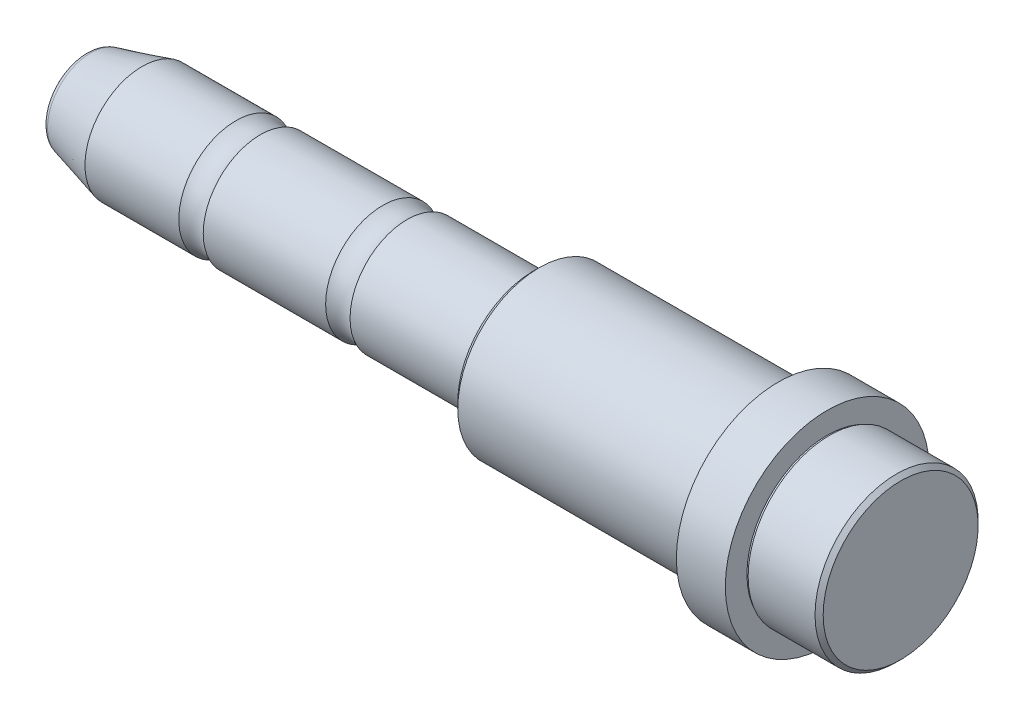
ISO-10303-21;
HEADER;
FILE_DESCRIPTION(('STEP AP214'),'2;1');
FILE_NAME('part.step','',(''),(''),'','','');
FILE_SCHEMA(('AUTOMOTIVE_DESIGN { 1 0 10303 214 1 1 1 1 }'));
ENDSEC;
DATA;
#1=APPLICATION_CONTEXT('core data for automotive mechanical design processes');
#2=APPLICATION_PROTOCOL_DEFINITION('international standard','automotive_design',2000,#1);
#3=PRODUCT_CONTEXT('',#1,'mechanical');
#4=PRODUCT('Part','Part','',(#3));
#5=PRODUCT_RELATED_PRODUCT_CATEGORY('part','',(#4));
#6=PRODUCT_DEFINITION_FORMATION('','',#4);
#7=PRODUCT_DEFINITION_CONTEXT('part definition',#1,'design');
#8=PRODUCT_DEFINITION('design','',#6,#7);
#9=PRODUCT_DEFINITION_SHAPE('','',#8);
#10=(LENGTH_UNIT() NAMED_UNIT(*) SI_UNIT(.MILLI.,.METRE.));
#11=(NAMED_UNIT(*) PLANE_ANGLE_UNIT() SI_UNIT($,.RADIAN.));
#12=(NAMED_UNIT(*) SI_UNIT($,.STERADIAN.) SOLID_ANGLE_UNIT());
#13=UNCERTAINTY_MEASURE_WITH_UNIT(LENGTH_MEASURE(1.E-05),#10,'distance_accuracy_value','');
#14=(GEOMETRIC_REPRESENTATION_CONTEXT(3) GLOBAL_UNCERTAINTY_ASSIGNED_CONTEXT((#13)) GLOBAL_UNIT_ASSIGNED_CONTEXT((#10,
#11,#12)) REPRESENTATION_CONTEXT('',''));
#15=CARTESIAN_POINT('',(0.,0.,0.));
#16=DIRECTION('',(0.,0.,1.));
#17=DIRECTION('',(1.,0.,0.));
#18=AXIS2_PLACEMENT_3D('',#15,#16,#17);
#19=CARTESIAN_POINT('',(90.9999999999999,0.,0.));
#20=DIRECTION('',(-1.,0.,0.));
#21=DIRECTION('',(0.,0.,1.));
#22=AXIS2_PLACEMENT_3D('',#19,#20,#21);
#23=CYLINDRICAL_SURFACE('',#22,7.);
#24=CARTESIAN_POINT('',(39.4966629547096,0.,0.));
#25=DIRECTION('',(-1.,0.,0.));
#26=DIRECTION('',(0.,0.,1.));
#27=AXIS2_PLACEMENT_3D('',#24,#25,#26);
#28=CIRCLE('',#27,7.);
#29=CARTESIAN_POINT('',(39.4966629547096,0.,7.));
#30=VERTEX_POINT('',#29);
#31=EDGE_CURVE('E18',#30,#30,#28,.T.);
#32=CARTESIAN_POINT('',(54.7,0.,0.));
#33=DIRECTION('',(-1.,0.,0.));
#34=DIRECTION('',(0.,0.,1.));
#35=AXIS2_PLACEMENT_3D('',#32,#33,#34);
#36=CIRCLE('',#35,7.);
#37=CARTESIAN_POINT('',(54.7,0.,7.));
#38=VERTEX_POINT('',#37);
#39=EDGE_CURVE('E54',#38,#38,#36,.T.);
#40=CARTESIAN_POINT('',(39.4966629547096,0.,7.));
#41=CARTESIAN_POINT('',(39.6550310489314,0.,7.));
#42=CARTESIAN_POINT('',(39.8133991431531,0.,7.));
#43=CARTESIAN_POINT('',(40.1301353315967,0.,7.));
#44=CARTESIAN_POINT('',(40.2885034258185,0.,7.));
#45=CARTESIAN_POINT('',(40.605239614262,0.,7.));
#46=CARTESIAN_POINT('',(40.7636077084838,0.,7.));
#47=CARTESIAN_POINT('',(41.0803438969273,0.,7.));
#48=CARTESIAN_POINT('',(41.2387119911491,0.,7.));
#49=CARTESIAN_POINT('',(41.5554481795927,0.,7.));
#50=CARTESIAN_POINT('',(41.7138162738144,0.,7.));
#51=CARTESIAN_POINT('',(42.030552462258,0.,7.));
#52=CARTESIAN_POINT('',(42.1889205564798,0.,7.));
#53=CARTESIAN_POINT('',(42.5056567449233,0.,7.));
#54=CARTESIAN_POINT('',(42.6640248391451,0.,7.));
#55=CARTESIAN_POINT('',(42.9807610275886,0.,7.));
#56=CARTESIAN_POINT('',(43.1391291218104,0.,7.));
#57=CARTESIAN_POINT('',(43.455865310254,0.,7.));
#58=CARTESIAN_POINT('',(43.6142334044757,0.,7.));
#59=CARTESIAN_POINT('',(43.9309695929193,0.,7.));
#60=CARTESIAN_POINT('',(44.0893376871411,0.,7.));
#61=CARTESIAN_POINT('',(44.4060738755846,0.,7.));
#62=CARTESIAN_POINT('',(44.5644419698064,0.,7.));
#63=CARTESIAN_POINT('',(44.8811781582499,0.,7.));
#64=CARTESIAN_POINT('',(45.0395462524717,0.,7.));
#65=CARTESIAN_POINT('',(45.3562824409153,0.,7.));
#66=CARTESIAN_POINT('',(45.514650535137,0.,7.));
#67=CARTESIAN_POINT('',(45.8313867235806,0.,7.));
#68=CARTESIAN_POINT('',(45.9897548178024,0.,7.));
#69=CARTESIAN_POINT('',(46.3064910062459,0.,7.));
#70=CARTESIAN_POINT('',(46.4648591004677,0.,7.));
#71=CARTESIAN_POINT('',(46.7815952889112,0.,7.));
#72=CARTESIAN_POINT('',(46.939963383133,0.,7.));
#73=CARTESIAN_POINT('',(47.2566995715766,0.,7.));
#74=CARTESIAN_POINT('',(47.4150676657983,0.,7.));
#75=CARTESIAN_POINT('',(47.7318038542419,0.,7.));
#76=CARTESIAN_POINT('',(47.8901719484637,0.,7.));
#77=CARTESIAN_POINT('',(48.2069081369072,0.,7.));
#78=CARTESIAN_POINT('',(48.365276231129,0.,7.));
#79=CARTESIAN_POINT('',(48.6820124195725,0.,7.));
#80=CARTESIAN_POINT('',(48.8403805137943,0.,7.));
#81=CARTESIAN_POINT('',(49.1571167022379,0.,7.));
#82=CARTESIAN_POINT('',(49.3154847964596,0.,7.));
#83=CARTESIAN_POINT('',(49.6322209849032,0.,7.));
#84=CARTESIAN_POINT('',(49.790589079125,0.,7.));
#85=CARTESIAN_POINT('',(50.1073252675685,0.,7.));
#86=CARTESIAN_POINT('',(50.2656933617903,0.,7.));
#87=CARTESIAN_POINT('',(50.5824295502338,0.,7.));
#88=CARTESIAN_POINT('',(50.7407976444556,0.,7.));
#89=CARTESIAN_POINT('',(51.0575338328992,0.,7.));
#90=CARTESIAN_POINT('',(51.2159019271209,0.,7.));
#91=CARTESIAN_POINT('',(51.5326381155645,0.,7.));
#92=CARTESIAN_POINT('',(51.6910062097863,0.,7.));
#93=CARTESIAN_POINT('',(52.0077423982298,0.,7.));
#94=CARTESIAN_POINT('',(52.1661104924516,0.,7.));
#95=CARTESIAN_POINT('',(52.4828466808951,0.,7.));
#96=CARTESIAN_POINT('',(52.6412147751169,0.,7.));
#97=CARTESIAN_POINT('',(52.9579509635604,0.,7.));
#98=CARTESIAN_POINT('',(53.1163190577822,0.,7.));
#99=CARTESIAN_POINT('',(53.4330552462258,0.,7.));
#100=CARTESIAN_POINT('',(53.5914233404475,0.,7.));
#101=CARTESIAN_POINT('',(53.9081595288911,0.,7.));
#102=CARTESIAN_POINT('',(54.0665276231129,0.,7.));
#103=CARTESIAN_POINT('',(54.3832638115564,0.,7.));
#104=CARTESIAN_POINT('',(54.5416319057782,0.,7.));
#105=CARTESIAN_POINT('',(54.7,0.,7.));
#106=B_SPLINE_CURVE_WITH_KNOTS('',3,(#40,#41,#42,#43,#44,#45,#46,#47,#48,#49,#50,#51,#52,#53,
#54,#55,#56,#57,#58,#59,#60,#61,#62,#63,#64,#65,#66,#67,#68,#69,#70,#71,#72,#73,#74,#75,#76,#77,
#78,#79,#80,#81,#82,#83,#84,#85,#86,#87,#88,#89,#90,#91,#92,#93,#94,#95,#96,#97,#98,#99,#100,
#101,#102,#103,#104,#105),.UNSPECIFIED.,.F.,.F.,(4,2,2,2,2,2,2,2,2,2,2,2,2,2,2,2,2,2,2,2,2,2,2,
2,2,2,2,2,2,2,2,2,4),(0.,0.475104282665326,0.950208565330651,1.42531284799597,1.9004171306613,
2.37552141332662,2.85062569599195,3.32572997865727,3.80083426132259,4.27593854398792,
4.75104282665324,5.22614710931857,5.70125139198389,6.17635567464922,6.65145995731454,
7.12656423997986,7.60166852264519,8.07677280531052,8.55187708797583,9.02698137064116,
9.50208565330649,9.97718993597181,10.4522942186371,10.9273985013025,11.4025027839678,
11.8776070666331,12.3527113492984,12.8278156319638,13.3029199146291,13.7780241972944,
14.2531284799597,14.728232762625,15.2033370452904),.UNSPECIFIED.);
#107=EDGE_CURVE('BSEAM14',#30,#38,#106,.T.);
#108=ORIENTED_EDGE('',*,*,#31,.F.);
#109=ORIENTED_EDGE('',*,*,#39,.T.);
#110=ORIENTED_EDGE('',*,*,#107,.T.);
#111=ORIENTED_EDGE('',*,*,#107,.F.);
#112=EDGE_LOOP('',(#108,#110,#109,#111));
#113=FACE_BOUND('',#112,.T.);
#114=ADVANCED_FACE('F14',(#113),#23,.T.);
#115=CARTESIAN_POINT('',(54.7,6.895,0.));
#116=DIRECTION('',(-1.,0.,0.));
#117=DIRECTION('',(0.,0.,1.));
#118=AXIS2_PLACEMENT_3D('',#115,#116,#117);
#119=PLANE('',#118);
#120=ORIENTED_EDGE('',*,*,#39,.F.);
#121=EDGE_LOOP('',(#120));
#122=FACE_BOUND('',#121,.T.);
#123=CARTESIAN_POINT('',(54.7,0.,0.));
#124=DIRECTION('',(-1.,0.,0.));
#125=DIRECTION('',(0.,0.,1.));
#126=AXIS2_PLACEMENT_3D('',#123,#124,#125);
#127=CIRCLE('',#126,6.895);
#128=CARTESIAN_POINT('',(54.7,0.,6.895));
#129=VERTEX_POINT('',#128);
#130=EDGE_CURVE('E56',#129,#129,#127,.T.);
#131=ORIENTED_EDGE('',*,*,#130,.T.);
#132=EDGE_LOOP('',(#131));
#133=FACE_BOUND('',#132,.T.);
#134=ADVANCED_FACE('F48',(#122,#133),#119,.F.);
#135=CARTESIAN_POINT('',(90.9999999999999,0.,0.));
#136=DIRECTION('',(-1.,0.,0.));
#137=DIRECTION('',(0.,0.,1.));
#138=AXIS2_PLACEMENT_3D('',#135,#136,#137);
#139=CYLINDRICAL_SURFACE('',#138,6.895);
#140=CARTESIAN_POINT('',(55.,0.,0.));
#141=DIRECTION('',(-1.,0.,0.));
#142=DIRECTION('',(0.,0.,1.));
#143=AXIS2_PLACEMENT_3D('',#140,#141,#142);
#144=CIRCLE('',#143,6.895);
#145=CARTESIAN_POINT('',(55.,0.,6.895));
#146=VERTEX_POINT('',#145);
#147=EDGE_CURVE('E60',#146,#146,#144,.T.);
#148=CARTESIAN_POINT('',(55.,0.,6.895));
#149=CARTESIAN_POINT('',(54.996875,0.,6.895));
#150=CARTESIAN_POINT('',(54.99375,0.,6.895));
#151=CARTESIAN_POINT('',(54.9875,0.,6.895));
#152=CARTESIAN_POINT('',(54.984375,0.,6.895));
#153=CARTESIAN_POINT('',(54.978125,0.,6.895));
#154=CARTESIAN_POINT('',(54.975,0.,6.895));
#155=CARTESIAN_POINT('',(54.96875,0.,6.895));
#156=CARTESIAN_POINT('',(54.965625,0.,6.895));
#157=CARTESIAN_POINT('',(54.959375,0.,6.895));
#158=CARTESIAN_POINT('',(54.95625,0.,6.895));
#159=CARTESIAN_POINT('',(54.95,0.,6.895));
#160=CARTESIAN_POINT('',(54.946875,0.,6.895));
#161=CARTESIAN_POINT('',(54.940625,0.,6.895));
#162=CARTESIAN_POINT('',(54.9375,0.,6.895));
#163=CARTESIAN_POINT('',(54.93125,0.,6.895));
#164=CARTESIAN_POINT('',(54.928125,0.,6.895));
#165=CARTESIAN_POINT('',(54.921875,0.,6.895));
#166=CARTESIAN_POINT('',(54.91875,0.,6.895));
#167=CARTESIAN_POINT('',(54.9125,0.,6.895));
#168=CARTESIAN_POINT('',(54.909375,0.,6.895));
#169=CARTESIAN_POINT('',(54.903125,0.,6.895));
#170=CARTESIAN_POINT('',(54.9,0.,6.895));
#171=CARTESIAN_POINT('',(54.89375,0.,6.895));
#172=CARTESIAN_POINT('',(54.890625,0.,6.895));
#173=CARTESIAN_POINT('',(54.884375,0.,6.895));
#174=CARTESIAN_POINT('',(54.88125,0.,6.895));
#175=CARTESIAN_POINT('',(54.875,0.,6.895));
#176=CARTESIAN_POINT('',(54.871875,0.,6.895));
#177=CARTESIAN_POINT('',(54.865625,0.,6.895));
#178=CARTESIAN_POINT('',(54.8625,0.,6.895));
#179=CARTESIAN_POINT('',(54.85625,0.,6.895));
#180=CARTESIAN_POINT('',(54.853125,0.,6.895));
#181=CARTESIAN_POINT('',(54.846875,0.,6.895));
#182=CARTESIAN_POINT('',(54.84375,0.,6.895));
#183=CARTESIAN_POINT('',(54.8375,0.,6.895));
#184=CARTESIAN_POINT('',(54.834375,0.,6.895));
#185=CARTESIAN_POINT('',(54.828125,0.,6.895));
#186=CARTESIAN_POINT('',(54.825,0.,6.895));
#187=CARTESIAN_POINT('',(54.81875,0.,6.895));
#188=CARTESIAN_POINT('',(54.815625,0.,6.895));
#189=CARTESIAN_POINT('',(54.809375,0.,6.895));
#190=CARTESIAN_POINT('',(54.80625,0.,6.895));
#191=CARTESIAN_POINT('',(54.8,0.,6.895));
#192=CARTESIAN_POINT('',(54.796875,0.,6.895));
#193=CARTESIAN_POINT('',(54.790625,0.,6.895));
#194=CARTESIAN_POINT('',(54.7875,0.,6.895));
#195=CARTESIAN_POINT('',(54.78125,0.,6.895));
#196=CARTESIAN_POINT('',(54.778125,0.,6.895));
#197=CARTESIAN_POINT('',(54.771875,0.,6.895));
#198=CARTESIAN_POINT('',(54.76875,0.,6.895));
#199=CARTESIAN_POINT('',(54.7625,0.,6.895));
#200=CARTESIAN_POINT('',(54.759375,0.,6.895));
#201=CARTESIAN_POINT('',(54.753125,0.,6.895));
#202=CARTESIAN_POINT('',(54.75,0.,6.895));
#203=CARTESIAN_POINT('',(54.74375,0.,6.895));
#204=CARTESIAN_POINT('',(54.740625,0.,6.895));
#205=CARTESIAN_POINT('',(54.734375,0.,6.895));
#206=CARTESIAN_POINT('',(54.73125,0.,6.895));
#207=CARTESIAN_POINT('',(54.725,0.,6.895));
#208=CARTESIAN_POINT('',(54.721875,0.,6.895));
#209=CARTESIAN_POINT('',(54.715625,0.,6.895));
#210=CARTESIAN_POINT('',(54.7125,0.,6.895));
#211=CARTESIAN_POINT('',(54.70625,0.,6.895));
#212=CARTESIAN_POINT('',(54.703125,0.,6.895));
#213=CARTESIAN_POINT('',(54.7,0.,6.895));
#214=B_SPLINE_CURVE_WITH_KNOTS('',3,(#148,#149,#150,#151,#152,#153,#154,#155,#156,#157,#158,
#159,#160,#161,#162,#163,#164,#165,#166,#167,#168,#169,#170,#171,#172,#173,#174,#175,#176,#177,
#178,#179,#180,#181,#182,#183,#184,#185,#186,#187,#188,#189,#190,#191,#192,#193,#194,#195,#196,
#197,#198,#199,#200,#201,#202,#203,#204,#205,#206,#207,#208,#209,#210,#211,#212,#213),
.UNSPECIFIED.,.F.,.F.,(4,2,2,2,2,2,2,2,2,2,2,2,2,2,2,2,2,2,2,2,2,2,2,2,2,2,2,2,2,2,2,2,4),(0.,
0.00937499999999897,0.0187499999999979,0.0281250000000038,0.0375000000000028,0.0468750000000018,
0.0562500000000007,0.0656249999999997,0.0750000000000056,0.0843750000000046,0.0937500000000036,
0.103125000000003,0.112500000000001,0.121875,0.131250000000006,0.140625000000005,
0.150000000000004,0.159375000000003,0.168750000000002,0.178125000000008,0.187500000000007,
0.196875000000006,0.206250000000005,0.215625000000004,0.225000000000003,0.234375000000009,
0.243750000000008,0.253125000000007,0.262500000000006,0.271875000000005,0.281250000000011,
0.29062500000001,0.300000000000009),.UNSPECIFIED.);
#215=EDGE_CURVE('BSEAM161',#146,#129,#214,.T.);
#216=ORIENTED_EDGE('',*,*,#147,.T.);
#217=ORIENTED_EDGE('',*,*,#130,.F.);
#218=ORIENTED_EDGE('',*,*,#215,.T.);
#219=ORIENTED_EDGE('',*,*,#215,.F.);
#220=EDGE_LOOP('',(#216,#218,#217,#219));
#221=FACE_BOUND('',#220,.T.);
#222=ADVANCED_FACE('F161',(#221),#139,.T.);
#223=CARTESIAN_POINT('',(55.,9.3,0.));
#224=DIRECTION('',(1.,0.,0.));
#225=DIRECTION('',(0.,0.,-1.));
#226=AXIS2_PLACEMENT_3D('',#223,#224,#225);
#227=PLANE('',#226);
#228=ORIENTED_EDGE('',*,*,#147,.F.);
#229=EDGE_LOOP('',(#228));
#230=FACE_BOUND('',#229,.T.);
#231=CARTESIAN_POINT('',(55.,0.,0.));
#232=DIRECTION('',(-1.,0.,0.));
#233=DIRECTION('',(0.,0.,1.));
#234=AXIS2_PLACEMENT_3D('',#231,#232,#233);
#235=CIRCLE('',#234,9.3);
#236=CARTESIAN_POINT('',(55.,0.,-9.30000000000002));
#237=VERTEX_POINT('',#236);
#238=EDGE_CURVE('E65',#237,#237,#235,.T.);
#239=ORIENTED_EDGE('',*,*,#238,.T.);
#240=EDGE_LOOP('',(#239));
#241=FACE_BOUND('',#240,.T.);
#242=ADVANCED_FACE('F157',(#230,#241),#227,.F.);
#243=CARTESIAN_POINT('',(55.7,0.,0.));
#244=DIRECTION('',(1.,0.,0.));
#245=DIRECTION('',(0.,0.,-1.));
#246=AXIS2_PLACEMENT_3D('',#243,#244,#245);
#247=CONICAL_SURFACE('',#246,10.,0.785398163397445);
#248=CARTESIAN_POINT('',(55.7,0.,0.));
#249=DIRECTION('',(-1.,0.,0.));
#250=DIRECTION('',(0.,0.,1.));
#251=AXIS2_PLACEMENT_3D('',#248,#249,#250);
#252=CIRCLE('',#251,10.);
#253=CARTESIAN_POINT('',(55.7,0.,-10.));
#254=VERTEX_POINT('',#253);
#255=EDGE_CURVE('E68',#254,#254,#252,.T.);
#256=CARTESIAN_POINT('',(55.,0.,-9.30000000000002));
#257=CARTESIAN_POINT('',(55.0072916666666,0.,-9.30729166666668));
#258=CARTESIAN_POINT('',(55.0145833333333,0.,-9.31458333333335));
#259=CARTESIAN_POINT('',(55.0291666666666,0.,-9.32916666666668));
#260=CARTESIAN_POINT('',(55.0364583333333,0.,-9.33645833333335));
#261=CARTESIAN_POINT('',(55.0510416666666,0.,-9.35104166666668));
#262=CARTESIAN_POINT('',(55.0583333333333,0.,-9.35833333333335));
#263=CARTESIAN_POINT('',(55.0729166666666,0.,-9.37291666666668));
#264=CARTESIAN_POINT('',(55.0802083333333,0.,-9.38020833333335));
#265=CARTESIAN_POINT('',(55.0947916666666,0.,-9.39479166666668));
#266=CARTESIAN_POINT('',(55.1020833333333,0.,-9.40208333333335));
#267=CARTESIAN_POINT('',(55.1166666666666,0.,-9.41666666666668));
#268=CARTESIAN_POINT('',(55.1239583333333,0.,-9.42395833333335));
#269=CARTESIAN_POINT('',(55.1385416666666,0.,-9.43854166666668));
#270=CARTESIAN_POINT('',(55.1458333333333,0.,-9.44583333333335));
#271=CARTESIAN_POINT('',(55.1604166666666,0.,-9.46041666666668));
#272=CARTESIAN_POINT('',(55.1677083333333,0.,-9.46770833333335));
#273=CARTESIAN_POINT('',(55.1822916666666,0.,-9.48229166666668));
#274=CARTESIAN_POINT('',(55.1895833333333,0.,-9.48958333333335));
#275=CARTESIAN_POINT('',(55.2041666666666,0.,-9.50416666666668));
#276=CARTESIAN_POINT('',(55.2114583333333,0.,-9.51145833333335));
#277=CARTESIAN_POINT('',(55.2260416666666,0.,-9.52604166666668));
#278=CARTESIAN_POINT('',(55.2333333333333,0.,-9.53333333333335));
#279=CARTESIAN_POINT('',(55.2479166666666,0.,-9.54791666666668));
#280=CARTESIAN_POINT('',(55.2552083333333,0.,-9.55520833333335));
#281=CARTESIAN_POINT('',(55.2697916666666,0.,-9.56979166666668));
#282=CARTESIAN_POINT('',(55.2770833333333,0.,-9.57708333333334));
#283=CARTESIAN_POINT('',(55.2916666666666,0.,-9.59166666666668));
#284=CARTESIAN_POINT('',(55.2989583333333,0.,-9.59895833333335));
#285=CARTESIAN_POINT('',(55.3135416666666,0.,-9.61354166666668));
#286=CARTESIAN_POINT('',(55.3208333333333,0.,-9.62083333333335));
#287=CARTESIAN_POINT('',(55.3354166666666,0.,-9.63541666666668));
#288=CARTESIAN_POINT('',(55.3427083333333,0.,-9.64270833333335));
#289=CARTESIAN_POINT('',(55.3572916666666,0.,-9.65729166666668));
#290=CARTESIAN_POINT('',(55.3645833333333,0.,-9.66458333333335));
#291=CARTESIAN_POINT('',(55.3791666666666,0.,-9.67916666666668));
#292=CARTESIAN_POINT('',(55.3864583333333,0.,-9.68645833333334));
#293=CARTESIAN_POINT('',(55.4010416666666,0.,-9.70104166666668));
#294=CARTESIAN_POINT('',(55.4083333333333,0.,-9.70833333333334));
#295=CARTESIAN_POINT('',(55.4229166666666,0.,-9.72291666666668));
#296=CARTESIAN_POINT('',(55.4302083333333,0.,-9.73020833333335));
#297=CARTESIAN_POINT('',(55.4447916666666,0.,-9.74479166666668));
#298=CARTESIAN_POINT('',(55.4520833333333,0.,-9.75208333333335));
#299=CARTESIAN_POINT('',(55.4666666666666,0.,-9.76666666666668));
#300=CARTESIAN_POINT('',(55.4739583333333,0.,-9.77395833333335));
#301=CARTESIAN_POINT('',(55.4885416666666,0.,-9.78854166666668));
#302=CARTESIAN_POINT('',(55.4958333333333,0.,-9.79583333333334));
#303=CARTESIAN_POINT('',(55.5104166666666,0.,-9.81041666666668));
#304=CARTESIAN_POINT('',(55.5177083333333,0.,-9.81770833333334));
#305=CARTESIAN_POINT('',(55.5322916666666,0.,-9.83229166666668));
#306=CARTESIAN_POINT('',(55.5395833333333,0.,-9.83958333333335));
#307=CARTESIAN_POINT('',(55.5541666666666,0.,-9.85416666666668));
#308=CARTESIAN_POINT('',(55.5614583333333,0.,-9.86145833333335));
#309=CARTESIAN_POINT('',(55.5760416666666,0.,-9.87604166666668));
#310=CARTESIAN_POINT('',(55.5833333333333,0.,-9.88333333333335));
#311=CARTESIAN_POINT('',(55.5979166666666,0.,-9.89791666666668));
#312=CARTESIAN_POINT('',(55.6052083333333,0.,-9.90520833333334));
#313=CARTESIAN_POINT('',(55.6197916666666,0.,-9.91979166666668));
#314=CARTESIAN_POINT('',(55.6270833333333,0.,-9.92708333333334));
#315=CARTESIAN_POINT('',(55.6416666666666,0.,-9.94166666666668));
#316=CARTESIAN_POINT('',(55.6489583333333,0.,-9.94895833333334));
#317=CARTESIAN_POINT('',(55.6635416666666,0.,-9.96354166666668));
#318=CARTESIAN_POINT('',(55.6708333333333,0.,-9.97083333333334));
#319=CARTESIAN_POINT('',(55.6854166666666,0.,-9.98541666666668));
#320=CARTESIAN_POINT('',(55.6927083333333,0.,-9.99270833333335));
#321=CARTESIAN_POINT('',(55.7,0.,-10.));
#322=B_SPLINE_CURVE_WITH_KNOTS('',3,(#256,#257,#258,#259,#260,#261,#262,#263,#264,#265,#266,
#267,#268,#269,#270,#271,#272,#273,#274,#275,#276,#277,#278,#279,#280,#281,#282,#283,#284,#285,
#286,#287,#288,#289,#290,#291,#292,#293,#294,#295,#296,#297,#298,#299,#300,#301,#302,#303,#304,
#305,#306,#307,#308,#309,#310,#311,#312,#313,#314,#315,#316,#317,#318,#319,#320,#321),
.UNSPECIFIED.,.F.,.F.,(4,2,2,2,2,2,2,2,2,2,2,2,2,2,2,2,2,2,2,2,2,2,2,2,2,2,2,2,2,2,2,2,4),(0.,
0.0309359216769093,0.0618718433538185,0.0928077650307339,0.123743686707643,0.154679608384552,
0.185615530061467,0.216551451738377,0.247487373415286,0.278423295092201,0.309359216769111,
0.34029513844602,0.371231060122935,0.402166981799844,0.433102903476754,0.464038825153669,
0.494974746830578,0.525910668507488,0.556846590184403,0.587782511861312,0.618718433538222,
0.649654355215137,0.680590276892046,0.711526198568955,0.74246212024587,0.77339804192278,
0.804333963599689,0.835269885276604,0.866205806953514,0.897141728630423,0.928077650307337,
0.959013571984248,0.989949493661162),.UNSPECIFIED.);
#323=EDGE_CURVE('BSEAM153',#237,#254,#322,.T.);
#324=ORIENTED_EDGE('',*,*,#238,.F.);
#325=ORIENTED_EDGE('',*,*,#255,.T.);
#326=ORIENTED_EDGE('',*,*,#323,.T.);
#327=ORIENTED_EDGE('',*,*,#323,.F.);
#328=EDGE_LOOP('',(#324,#326,#325,#327));
#329=FACE_BOUND('',#328,.T.);
#330=ADVANCED_FACE('F153',(#329),#247,.T.);
#331=CARTESIAN_POINT('',(90.9999999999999,0.,0.));
#332=DIRECTION('',(-1.,0.,0.));
#333=DIRECTION('',(0.,0.,1.));
#334=AXIS2_PLACEMENT_3D('',#331,#332,#333);
#335=CYLINDRICAL_SURFACE('',#334,10.);
#336=ORIENTED_EDGE('',*,*,#255,.F.);
#337=EDGE_LOOP('',(#336));
#338=FACE_BOUND('',#337,.T.);
#339=CARTESIAN_POINT('',(84.6999999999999,0.,0.));
#340=DIRECTION('',(-1.,0.,0.));
#341=DIRECTION('',(0.,0.,1.));
#342=AXIS2_PLACEMENT_3D('',#339,#340,#341);
#343=CIRCLE('',#342,10.);
#344=CARTESIAN_POINT('',(84.6999999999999,0.,10.));
#345=VERTEX_POINT('',#344);
#346=EDGE_CURVE('E71',#345,#345,#343,.T.);
#347=ORIENTED_EDGE('',*,*,#346,.T.);
#348=EDGE_LOOP('',(#347));
#349=FACE_BOUND('',#348,.T.);
#350=ADVANCED_FACE('F149',(#338,#349),#335,.T.);
#351=CARTESIAN_POINT('',(84.6999999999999,9.85,0.));
#352=DIRECTION('',(-1.,0.,0.));
#353=DIRECTION('',(0.,0.,1.));
#354=AXIS2_PLACEMENT_3D('',#351,#352,#353);
#355=PLANE('',#354);
#356=ORIENTED_EDGE('',*,*,#346,.F.);
#357=EDGE_LOOP('',(#356));
#358=FACE_BOUND('',#357,.T.);
#359=CARTESIAN_POINT('',(84.6999999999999,0.,0.));
#360=DIRECTION('',(-1.,0.,0.));
#361=DIRECTION('',(0.,0.,1.));
#362=AXIS2_PLACEMENT_3D('',#359,#360,#361);
#363=CIRCLE('',#362,9.85);
#364=CARTESIAN_POINT('',(84.7,0.,9.85));
#365=VERTEX_POINT('',#364);
#366=EDGE_CURVE('E74',#365,#365,#363,.T.);
#367=ORIENTED_EDGE('',*,*,#366,.T.);
#368=EDGE_LOOP('',(#367));
#369=FACE_BOUND('',#368,.T.);
#370=ADVANCED_FACE('F145',(#358,#369),#355,.F.);
#371=CARTESIAN_POINT('',(90.9999999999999,0.,0.));
#372=DIRECTION('',(-1.,0.,0.));
#373=DIRECTION('',(0.,0.,1.));
#374=AXIS2_PLACEMENT_3D('',#371,#372,#373);
#375=CYLINDRICAL_SURFACE('',#374,9.85);
#376=CARTESIAN_POINT('',(85.,0.,0.));
#377=DIRECTION('',(-1.,0.,0.));
#378=DIRECTION('',(0.,0.,1.));
#379=AXIS2_PLACEMENT_3D('',#376,#377,#378);
#380=CIRCLE('',#379,9.85);
#381=CARTESIAN_POINT('',(85.,0.,9.85));
#382=VERTEX_POINT('',#381);
#383=EDGE_CURVE('E77',#382,#382,#380,.T.);
#384=CARTESIAN_POINT('',(84.7,0.,9.85));
#385=CARTESIAN_POINT('',(84.7031249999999,0.,9.85));
#386=CARTESIAN_POINT('',(84.70625,0.,9.85));
#387=CARTESIAN_POINT('',(84.7124999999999,0.,9.85));
#388=CARTESIAN_POINT('',(84.7156249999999,0.,9.85));
#389=CARTESIAN_POINT('',(84.7218749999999,0.,9.85));
#390=CARTESIAN_POINT('',(84.725,0.,9.85));
#391=CARTESIAN_POINT('',(84.7312499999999,0.,9.85));
#392=CARTESIAN_POINT('',(84.7343749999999,0.,9.85));
#393=CARTESIAN_POINT('',(84.7406249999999,0.,9.85));
#394=CARTESIAN_POINT('',(84.7437499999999,0.,9.85));
#395=CARTESIAN_POINT('',(84.75,0.,9.85));
#396=CARTESIAN_POINT('',(84.7531249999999,0.,9.85));
#397=CARTESIAN_POINT('',(84.759375,0.,9.85));
#398=CARTESIAN_POINT('',(84.7624999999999,0.,9.85));
#399=CARTESIAN_POINT('',(84.76875,0.,9.85));
#400=CARTESIAN_POINT('',(84.771875,0.,9.85));
#401=CARTESIAN_POINT('',(84.778125,0.,9.85));
#402=CARTESIAN_POINT('',(84.7812499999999,0.,9.85));
#403=CARTESIAN_POINT('',(84.7875,0.,9.85));
#404=CARTESIAN_POINT('',(84.7906249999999,0.,9.85));
#405=CARTESIAN_POINT('',(84.796875,0.,9.85));
#406=CARTESIAN_POINT('',(84.7999999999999,0.,9.85));
#407=CARTESIAN_POINT('',(84.80625,0.,9.85));
#408=CARTESIAN_POINT('',(84.8093749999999,0.,9.85));
#409=CARTESIAN_POINT('',(84.815625,0.,9.85));
#410=CARTESIAN_POINT('',(84.81875,0.,9.85));
#411=CARTESIAN_POINT('',(84.825,0.,9.85));
#412=CARTESIAN_POINT('',(84.8281249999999,0.,9.85));
#413=CARTESIAN_POINT('',(84.834375,0.,9.85));
#414=CARTESIAN_POINT('',(84.8374999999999,0.,9.85));
#415=CARTESIAN_POINT('',(84.84375,0.,9.85));
#416=CARTESIAN_POINT('',(84.8468749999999,0.,9.85));
#417=CARTESIAN_POINT('',(84.853125,0.,9.85));
#418=CARTESIAN_POINT('',(84.8562499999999,0.,9.85));
#419=CARTESIAN_POINT('',(84.8625,0.,9.85));
#420=CARTESIAN_POINT('',(84.865625,0.,9.85));
#421=CARTESIAN_POINT('',(84.871875,0.,9.85));
#422=CARTESIAN_POINT('',(84.875,0.,9.85));
#423=CARTESIAN_POINT('',(84.88125,0.,9.85));
#424=CARTESIAN_POINT('',(84.884375,0.,9.85));
#425=CARTESIAN_POINT('',(84.890625,0.,9.85));
#426=CARTESIAN_POINT('',(84.89375,0.,9.85));
#427=CARTESIAN_POINT('',(84.9,0.,9.85));
#428=CARTESIAN_POINT('',(84.903125,0.,9.85));
#429=CARTESIAN_POINT('',(84.909375,0.,9.85));
#430=CARTESIAN_POINT('',(84.9125,0.,9.85));
#431=CARTESIAN_POINT('',(84.91875,0.,9.85));
#432=CARTESIAN_POINT('',(84.921875,0.,9.85));
#433=CARTESIAN_POINT('',(84.928125,0.,9.85));
#434=CARTESIAN_POINT('',(84.93125,0.,9.85));
#435=CARTESIAN_POINT('',(84.9375,0.,9.85));
#436=CARTESIAN_POINT('',(84.940625,0.,9.85));
#437=CARTESIAN_POINT('',(84.946875,0.,9.85));
#438=CARTESIAN_POINT('',(84.95,0.,9.85));
#439=CARTESIAN_POINT('',(84.95625,0.,9.85));
#440=CARTESIAN_POINT('',(84.959375,0.,9.85));
#441=CARTESIAN_POINT('',(84.965625,0.,9.85));
#442=CARTESIAN_POINT('',(84.96875,0.,9.85));
#443=CARTESIAN_POINT('',(84.975,0.,9.85));
#444=CARTESIAN_POINT('',(84.978125,0.,9.85));
#445=CARTESIAN_POINT('',(84.984375,0.,9.85));
#446=CARTESIAN_POINT('',(84.9875,0.,9.85));
#447=CARTESIAN_POINT('',(84.9937499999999,0.,9.85));
#448=CARTESIAN_POINT('',(84.996875,0.,9.85));
#449=CARTESIAN_POINT('',(85.,0.,9.85));
#450=B_SPLINE_CURVE_WITH_KNOTS('',3,(#384,#385,#386,#387,#388,#389,#390,#391,#392,#393,#394,
#395,#396,#397,#398,#399,#400,#401,#402,#403,#404,#405,#406,#407,#408,#409,#410,#411,#412,#413,
#414,#415,#416,#417,#418,#419,#420,#421,#422,#423,#424,#425,#426,#427,#428,#429,#430,#431,#432,
#433,#434,#435,#436,#437,#438,#439,#440,#441,#442,#443,#444,#445,#446,#447,#448,#449),
.UNSPECIFIED.,.F.,.F.,(4,2,2,2,2,2,2,2,2,2,2,2,2,2,2,2,2,2,2,2,2,2,2,2,2,2,2,2,2,2,2,2,4),(0.,
0.00937499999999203,0.0187499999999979,0.02812499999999,0.0374999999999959,0.0468749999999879,
0.0562499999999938,0.0656249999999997,0.0749999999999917,0.0843749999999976,0.0937499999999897,
0.103124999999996,0.112500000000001,0.121874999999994,0.131249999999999,0.140624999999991,
0.149999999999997,0.159375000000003,0.168749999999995,0.178125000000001,0.187499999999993,
0.196874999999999,0.206250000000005,0.215624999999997,0.225000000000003,0.234374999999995,
0.243750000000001,0.253125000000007,0.262499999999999,0.271875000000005,0.281249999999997,
0.290625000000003,0.299999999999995),.UNSPECIFIED.);
#451=EDGE_CURVE('BSEAM141',#365,#382,#450,.T.);
#452=ORIENTED_EDGE('',*,*,#366,.F.);
#453=ORIENTED_EDGE('',*,*,#383,.T.);
#454=ORIENTED_EDGE('',*,*,#451,.T.);
#455=ORIENTED_EDGE('',*,*,#451,.F.);
#456=EDGE_LOOP('',(#452,#454,#453,#455));
#457=FACE_BOUND('',#456,.T.);
#458=ADVANCED_FACE('F141',(#457),#375,.T.);
#459=CARTESIAN_POINT('',(85.,12.5,0.));
#460=DIRECTION('',(1.,0.,0.));
#461=DIRECTION('',(0.,0.,-1.));
#462=AXIS2_PLACEMENT_3D('',#459,#460,#461);
#463=PLANE('',#462);
#464=ORIENTED_EDGE('',*,*,#383,.F.);
#465=EDGE_LOOP('',(#464));
#466=FACE_BOUND('',#465,.T.);
#467=CARTESIAN_POINT('',(85.,0.,0.));
#468=DIRECTION('',(-1.,0.,0.));
#469=DIRECTION('',(0.,0.,1.));
#470=AXIS2_PLACEMENT_3D('',#467,#468,#469);
#471=CIRCLE('',#470,12.5);
#472=CARTESIAN_POINT('',(85.,0.,12.5));
#473=VERTEX_POINT('',#472);
#474=EDGE_CURVE('E80',#473,#473,#471,.T.);
#475=ORIENTED_EDGE('',*,*,#474,.T.);
#476=EDGE_LOOP('',(#475));
#477=FACE_BOUND('',#476,.T.);
#478=ADVANCED_FACE('F137',(#466,#477),#463,.F.);
#479=CARTESIAN_POINT('',(90.9999999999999,0.,0.));
#480=DIRECTION('',(-1.,0.,0.));
#481=DIRECTION('',(0.,0.,1.));
#482=AXIS2_PLACEMENT_3D('',#479,#480,#481);
#483=CYLINDRICAL_SURFACE('',#482,12.5);
#484=CARTESIAN_POINT('',(90.9999999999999,0.,0.));
#485=DIRECTION('',(-1.,0.,0.));
#486=DIRECTION('',(0.,0.,1.));
#487=AXIS2_PLACEMENT_3D('',#484,#485,#486);
#488=CIRCLE('',#487,12.5);
#489=CARTESIAN_POINT('',(91.,0.,12.5));
#490=VERTEX_POINT('',#489);
#491=EDGE_CURVE('E83',#490,#490,#488,.T.);
#492=CARTESIAN_POINT('',(85.,0.,12.5));
#493=CARTESIAN_POINT('',(85.0625,0.,12.5));
#494=CARTESIAN_POINT('',(85.125,0.,12.5));
#495=CARTESIAN_POINT('',(85.25,0.,12.5));
#496=CARTESIAN_POINT('',(85.3125,0.,12.5));
#497=CARTESIAN_POINT('',(85.4375,0.,12.5));
#498=CARTESIAN_POINT('',(85.5,0.,12.5));
#499=CARTESIAN_POINT('',(85.625,0.,12.5));
#500=CARTESIAN_POINT('',(85.6875,0.,12.5));
#501=CARTESIAN_POINT('',(85.8125,0.,12.5));
#502=CARTESIAN_POINT('',(85.875,0.,12.5));
#503=CARTESIAN_POINT('',(86.,0.,12.5));
#504=CARTESIAN_POINT('',(86.0625,0.,12.5));
#505=CARTESIAN_POINT('',(86.1875,0.,12.5));
#506=CARTESIAN_POINT('',(86.25,0.,12.5));
#507=CARTESIAN_POINT('',(86.375,0.,12.5));
#508=CARTESIAN_POINT('',(86.4375,0.,12.5));
#509=CARTESIAN_POINT('',(86.5625,0.,12.5));
#510=CARTESIAN_POINT('',(86.625,0.,12.5));
#511=CARTESIAN_POINT('',(86.75,0.,12.5));
#512=CARTESIAN_POINT('',(86.8125,0.,12.5));
#513=CARTESIAN_POINT('',(86.9375,0.,12.5));
#514=CARTESIAN_POINT('',(87.,0.,12.5));
#515=CARTESIAN_POINT('',(87.125,0.,12.5));
#516=CARTESIAN_POINT('',(87.1875,0.,12.5));
#517=CARTESIAN_POINT('',(87.3125,0.,12.5));
#518=CARTESIAN_POINT('',(87.375,0.,12.5));
#519=CARTESIAN_POINT('',(87.5,0.,12.5));
#520=CARTESIAN_POINT('',(87.5625,0.,12.5));
#521=CARTESIAN_POINT('',(87.6875,0.,12.5));
#522=CARTESIAN_POINT('',(87.75,0.,12.5));
#523=CARTESIAN_POINT('',(87.875,0.,12.5));
#524=CARTESIAN_POINT('',(87.9375,0.,12.5));
#525=CARTESIAN_POINT('',(88.0624999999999,0.,12.5));
#526=CARTESIAN_POINT('',(88.125,0.,12.5));
#527=CARTESIAN_POINT('',(88.25,0.,12.5));
#528=CARTESIAN_POINT('',(88.3124999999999,0.,12.5));
#529=CARTESIAN_POINT('',(88.4374999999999,0.,12.5));
#530=CARTESIAN_POINT('',(88.5,0.,12.5));
#531=CARTESIAN_POINT('',(88.625,0.,12.5));
#532=CARTESIAN_POINT('',(88.6874999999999,0.,12.5));
#533=CARTESIAN_POINT('',(88.8124999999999,0.,12.5));
#534=CARTESIAN_POINT('',(88.875,0.,12.5));
#535=CARTESIAN_POINT('',(89.,0.,12.5));
#536=CARTESIAN_POINT('',(89.0624999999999,0.,12.5));
#537=CARTESIAN_POINT('',(89.1874999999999,0.,12.5));
#538=CARTESIAN_POINT('',(89.25,0.,12.5));
#539=CARTESIAN_POINT('',(89.375,0.,12.5));
#540=CARTESIAN_POINT('',(89.4374999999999,0.,12.5));
#541=CARTESIAN_POINT('',(89.5624999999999,0.,12.5));
#542=CARTESIAN_POINT('',(89.625,0.,12.5));
#543=CARTESIAN_POINT('',(89.75,0.,12.5));
#544=CARTESIAN_POINT('',(89.8124999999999,0.,12.5));
#545=CARTESIAN_POINT('',(89.9374999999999,0.,12.5));
#546=CARTESIAN_POINT('',(90.,0.,12.5));
#547=CARTESIAN_POINT('',(90.125,0.,12.5));
#548=CARTESIAN_POINT('',(90.1874999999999,0.,12.5));
#549=CARTESIAN_POINT('',(90.3124999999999,0.,12.5));
#550=CARTESIAN_POINT('',(90.375,0.,12.5));
#551=CARTESIAN_POINT('',(90.5,0.,12.5));
#552=CARTESIAN_POINT('',(90.5624999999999,0.,12.5));
#553=CARTESIAN_POINT('',(90.6874999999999,0.,12.5));
#554=CARTESIAN_POINT('',(90.75,0.,12.5));
#555=CARTESIAN_POINT('',(90.8749999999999,0.,12.5));
#556=CARTESIAN_POINT('',(90.9374999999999,0.,12.5));
#557=CARTESIAN_POINT('',(90.9999999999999,0.,12.5));
#558=B_SPLINE_CURVE_WITH_KNOTS('',3,(#492,#493,#494,#495,#496,#497,#498,#499,#500,#501,#502,
#503,#504,#505,#506,#507,#508,#509,#510,#511,#512,#513,#514,#515,#516,#517,#518,#519,#520,#521,
#522,#523,#524,#525,#526,#527,#528,#529,#530,#531,#532,#533,#534,#535,#536,#537,#538,#539,#540,
#541,#542,#543,#544,#545,#546,#547,#548,#549,#550,#551,#552,#553,#554,#555,#556,#557),
.UNSPECIFIED.,.F.,.F.,(4,2,2,2,2,2,2,2,2,2,2,2,2,2,2,2,2,2,2,2,2,2,2,2,2,2,2,2,2,2,2,2,4),(0.,
0.187500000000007,0.375,0.562500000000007,0.750000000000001,0.937500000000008,1.125,
1.31250000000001,1.5,1.68750000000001,1.875,2.06250000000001,2.25,2.43750000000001,2.625,
2.81250000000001,3.,3.1875,3.375,3.5625,3.75,3.9375,4.125,4.3125,4.5,4.6875,4.875,5.0625,5.25,
5.4375,5.62500000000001,5.8125,5.99999999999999),.UNSPECIFIED.);
#559=EDGE_CURVE('BSEAM133',#473,#490,#558,.T.);
#560=ORIENTED_EDGE('',*,*,#474,.F.);
#561=ORIENTED_EDGE('',*,*,#491,.T.);
#562=ORIENTED_EDGE('',*,*,#559,.T.);
#563=ORIENTED_EDGE('',*,*,#559,.F.);
#564=EDGE_LOOP('',(#560,#562,#561,#563));
#565=FACE_BOUND('',#564,.T.);
#566=ADVANCED_FACE('F133',(#565),#483,.T.);
#567=CARTESIAN_POINT('',(90.9999999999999,12.5,0.));
#568=DIRECTION('',(1.,0.,0.));
#569=DIRECTION('',(0.,0.,-1.));
#570=AXIS2_PLACEMENT_3D('',#567,#568,#569);
#571=PLANE('',#570);
#572=CARTESIAN_POINT('',(90.9999999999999,0.,0.));
#573=DIRECTION('',(-1.,0.,0.));
#574=DIRECTION('',(0.,0.,1.));
#575=AXIS2_PLACEMENT_3D('',#572,#573,#574);
#576=CIRCLE('',#575,9.85);
#577=CARTESIAN_POINT('',(90.9999999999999,0.,9.85));
#578=VERTEX_POINT('',#577);
#579=EDGE_CURVE('E86',#578,#578,#576,.T.);
#580=ORIENTED_EDGE('',*,*,#579,.T.);
#581=EDGE_LOOP('',(#580));
#582=FACE_BOUND('',#581,.T.);
#583=ORIENTED_EDGE('',*,*,#491,.F.);
#584=EDGE_LOOP('',(#583));
#585=FACE_BOUND('',#584,.T.);
#586=ADVANCED_FACE('F129',(#582,#585),#571,.T.);
#587=CARTESIAN_POINT('',(90.9999999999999,0.,0.));
#588=DIRECTION('',(-1.,0.,0.));
#589=DIRECTION('',(0.,0.,1.));
#590=AXIS2_PLACEMENT_3D('',#587,#588,#589);
#591=CYLINDRICAL_SURFACE('',#590,9.85);
#592=CARTESIAN_POINT('',(91.3,0.,0.));
#593=DIRECTION('',(-1.,0.,0.));
#594=DIRECTION('',(0.,0.,1.));
#595=AXIS2_PLACEMENT_3D('',#592,#593,#594);
#596=CIRCLE('',#595,9.85);
#597=CARTESIAN_POINT('',(91.3,0.,9.85));
#598=VERTEX_POINT('',#597);
#599=EDGE_CURVE('E89',#598,#598,#596,.T.);
#600=CARTESIAN_POINT('',(91.3,0.,9.85));
#601=CARTESIAN_POINT('',(91.296875,0.,9.85));
#602=CARTESIAN_POINT('',(91.29375,0.,9.85));
#603=CARTESIAN_POINT('',(91.2875,0.,9.85));
#604=CARTESIAN_POINT('',(91.284375,0.,9.85));
#605=CARTESIAN_POINT('',(91.278125,0.,9.85));
#606=CARTESIAN_POINT('',(91.2749999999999,0.,9.85));
#607=CARTESIAN_POINT('',(91.26875,0.,9.85));
#608=CARTESIAN_POINT('',(91.265625,0.,9.85));
#609=CARTESIAN_POINT('',(91.259375,0.,9.85));
#610=CARTESIAN_POINT('',(91.25625,0.,9.85));
#611=CARTESIAN_POINT('',(91.25,0.,9.85));
#612=CARTESIAN_POINT('',(91.246875,0.,9.85));
#613=CARTESIAN_POINT('',(91.240625,0.,9.85));
#614=CARTESIAN_POINT('',(91.2375,0.,9.85));
#615=CARTESIAN_POINT('',(91.23125,0.,9.85));
#616=CARTESIAN_POINT('',(91.2281249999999,0.,9.85));
#617=CARTESIAN_POINT('',(91.221875,0.,9.85));
#618=CARTESIAN_POINT('',(91.21875,0.,9.85));
#619=CARTESIAN_POINT('',(91.2125,0.,9.85));
#620=CARTESIAN_POINT('',(91.209375,0.,9.85));
#621=CARTESIAN_POINT('',(91.203125,0.,9.85));
#622=CARTESIAN_POINT('',(91.2,0.,9.85));
#623=CARTESIAN_POINT('',(91.19375,0.,9.85));
#624=CARTESIAN_POINT('',(91.190625,0.,9.85));
#625=CARTESIAN_POINT('',(91.184375,0.,9.85));
#626=CARTESIAN_POINT('',(91.1812499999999,0.,9.85));
#627=CARTESIAN_POINT('',(91.175,0.,9.85));
#628=CARTESIAN_POINT('',(91.171875,0.,9.85));
#629=CARTESIAN_POINT('',(91.165625,0.,9.85));
#630=CARTESIAN_POINT('',(91.1625,0.,9.85));
#631=CARTESIAN_POINT('',(91.15625,0.,9.85));
#632=CARTESIAN_POINT('',(91.153125,0.,9.85));
#633=CARTESIAN_POINT('',(91.146875,0.,9.85));
#634=CARTESIAN_POINT('',(91.14375,0.,9.85));
#635=CARTESIAN_POINT('',(91.1375,0.,9.85));
#636=CARTESIAN_POINT('',(91.1343749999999,0.,9.85));
#637=CARTESIAN_POINT('',(91.128125,0.,9.85));
#638=CARTESIAN_POINT('',(91.125,0.,9.85));
#639=CARTESIAN_POINT('',(91.11875,0.,9.85));
#640=CARTESIAN_POINT('',(91.115625,0.,9.85));
#641=CARTESIAN_POINT('',(91.109375,0.,9.85));
#642=CARTESIAN_POINT('',(91.10625,0.,9.85));
#643=CARTESIAN_POINT('',(91.1,0.,9.85));
#644=CARTESIAN_POINT('',(91.096875,0.,9.85));
#645=CARTESIAN_POINT('',(91.0906249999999,0.,9.85));
#646=CARTESIAN_POINT('',(91.0874999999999,0.,9.85));
#647=CARTESIAN_POINT('',(91.0812499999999,0.,9.85));
#648=CARTESIAN_POINT('',(91.078125,0.,9.85));
#649=CARTESIAN_POINT('',(91.0718749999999,0.,9.85));
#650=CARTESIAN_POINT('',(91.06875,0.,9.85));
#651=CARTESIAN_POINT('',(91.0624999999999,0.,9.85));
#652=CARTESIAN_POINT('',(91.059375,0.,9.85));
#653=CARTESIAN_POINT('',(91.0531249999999,0.,9.85));
#654=CARTESIAN_POINT('',(91.05,0.,9.85));
#655=CARTESIAN_POINT('',(91.0437499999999,0.,9.85));
#656=CARTESIAN_POINT('',(91.0406249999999,0.,9.85));
#657=CARTESIAN_POINT('',(91.0343749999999,0.,9.85));
#658=CARTESIAN_POINT('',(91.03125,0.,9.85));
#659=CARTESIAN_POINT('',(91.0249999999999,0.,9.85));
#660=CARTESIAN_POINT('',(91.021875,0.,9.85));
#661=CARTESIAN_POINT('',(91.0156249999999,0.,9.85));
#662=CARTESIAN_POINT('',(91.0125,0.,9.85));
#663=CARTESIAN_POINT('',(91.0062499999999,0.,9.85));
#664=CARTESIAN_POINT('',(91.003125,0.,9.85));
#665=CARTESIAN_POINT('',(90.9999999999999,0.,9.85));
#666=B_SPLINE_CURVE_WITH_KNOTS('',3,(#600,#601,#602,#603,#604,#605,#606,#607,#608,#609,#610,
#611,#612,#613,#614,#615,#616,#617,#618,#619,#620,#621,#622,#623,#624,#625,#626,#627,#628,#629,
#630,#631,#632,#633,#634,#635,#636,#637,#638,#639,#640,#641,#642,#643,#644,#645,#646,#647,#648,
#649,#650,#651,#652,#653,#654,#655,#656,#657,#658,#659,#660,#661,#662,#663,#664,#665),
.UNSPECIFIED.,.F.,.F.,(4,2,2,2,2,2,2,2,2,2,2,2,2,2,2,2,2,2,2,2,2,2,2,2,2,2,2,2,2,2,2,2,4),(0.,
0.00937500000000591,0.0187500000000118,0.0281250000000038,0.0375000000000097,0.0468750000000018,
0.0562500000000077,0.0656250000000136,0.0750000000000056,0.0843750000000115,0.0937500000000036,
0.103125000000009,0.112500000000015,0.121875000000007,0.131250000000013,0.140625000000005,
0.150000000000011,0.159375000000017,0.168750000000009,0.178125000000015,0.187500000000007,
0.196875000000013,0.206250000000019,0.215625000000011,0.225000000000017,0.234375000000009,
0.243750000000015,0.253125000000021,0.262500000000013,0.271875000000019,0.281250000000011,
0.290625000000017,0.300000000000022),.UNSPECIFIED.);
#667=EDGE_CURVE('BSEAM125',#598,#578,#666,.T.);
#668=ORIENTED_EDGE('',*,*,#599,.T.);
#669=ORIENTED_EDGE('',*,*,#579,.F.);
#670=ORIENTED_EDGE('',*,*,#667,.T.);
#671=ORIENTED_EDGE('',*,*,#667,.F.);
#672=EDGE_LOOP('',(#668,#670,#669,#671));
#673=FACE_BOUND('',#672,.T.);
#674=ADVANCED_FACE('F125',(#673),#591,.T.);
#675=CARTESIAN_POINT('',(91.3,9.85,0.));
#676=DIRECTION('',(-1.,0.,0.));
#677=DIRECTION('',(0.,0.,1.));
#678=AXIS2_PLACEMENT_3D('',#675,#676,#677);
#679=PLANE('',#678);
#680=CARTESIAN_POINT('',(91.3,0.,0.));
#681=DIRECTION('',(-1.,0.,0.));
#682=DIRECTION('',(0.,0.,1.));
#683=AXIS2_PLACEMENT_3D('',#680,#681,#682);
#684=CIRCLE('',#683,10.);
#685=CARTESIAN_POINT('',(91.3,0.,10.));
#686=VERTEX_POINT('',#685);
#687=EDGE_CURVE('E92',#686,#686,#684,.T.);
#688=ORIENTED_EDGE('',*,*,#687,.T.);
#689=EDGE_LOOP('',(#688));
#690=FACE_BOUND('',#689,.T.);
#691=ORIENTED_EDGE('',*,*,#599,.F.);
#692=EDGE_LOOP('',(#691));
#693=FACE_BOUND('',#692,.T.);
#694=ADVANCED_FACE('F121',(#690,#693),#679,.T.);
#695=CARTESIAN_POINT('',(90.9999999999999,0.,0.));
#696=DIRECTION('',(-1.,0.,0.));
#697=DIRECTION('',(0.,0.,1.));
#698=AXIS2_PLACEMENT_3D('',#695,#696,#697);
#699=CYLINDRICAL_SURFACE('',#698,10.);
#700=CARTESIAN_POINT('',(99.4999999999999,0.,0.));
#701=DIRECTION('',(-1.,0.,0.));
#702=DIRECTION('',(0.,0.,1.));
#703=AXIS2_PLACEMENT_3D('',#700,#701,#702);
#704=CIRCLE('',#703,10.);
#705=CARTESIAN_POINT('',(99.4999999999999,0.,10.));
#706=VERTEX_POINT('',#705);
#707=EDGE_CURVE('E95',#706,#706,#704,.T.);
#708=CARTESIAN_POINT('',(91.3,0.,10.));
#709=CARTESIAN_POINT('',(91.3854166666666,0.,10.));
#710=CARTESIAN_POINT('',(91.4708333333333,0.,10.));
#711=CARTESIAN_POINT('',(91.6416666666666,0.,10.));
#712=CARTESIAN_POINT('',(91.7270833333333,0.,10.));
#713=CARTESIAN_POINT('',(91.8979166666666,0.,10.));
#714=CARTESIAN_POINT('',(91.9833333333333,0.,10.));
#715=CARTESIAN_POINT('',(92.1541666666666,0.,10.));
#716=CARTESIAN_POINT('',(92.2395833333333,0.,10.));
#717=CARTESIAN_POINT('',(92.4104166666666,0.,10.));
#718=CARTESIAN_POINT('',(92.4958333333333,0.,10.));
#719=CARTESIAN_POINT('',(92.6666666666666,0.,10.));
#720=CARTESIAN_POINT('',(92.7520833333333,0.,10.));
#721=CARTESIAN_POINT('',(92.9229166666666,0.,10.));
#722=CARTESIAN_POINT('',(93.0083333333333,0.,10.));
#723=CARTESIAN_POINT('',(93.1791666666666,0.,10.));
#724=CARTESIAN_POINT('',(93.2645833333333,0.,10.));
#725=CARTESIAN_POINT('',(93.4354166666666,0.,10.));
#726=CARTESIAN_POINT('',(93.5208333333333,0.,10.));
#727=CARTESIAN_POINT('',(93.6916666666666,0.,10.));
#728=CARTESIAN_POINT('',(93.7770833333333,0.,10.));
#729=CARTESIAN_POINT('',(93.9479166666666,0.,10.));
#730=CARTESIAN_POINT('',(94.0333333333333,0.,10.));
#731=CARTESIAN_POINT('',(94.2041666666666,0.,10.));
#732=CARTESIAN_POINT('',(94.2895833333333,0.,10.));
#733=CARTESIAN_POINT('',(94.4604166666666,0.,10.));
#734=CARTESIAN_POINT('',(94.5458333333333,0.,10.));
#735=CARTESIAN_POINT('',(94.7166666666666,0.,10.));
#736=CARTESIAN_POINT('',(94.8020833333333,0.,10.));
#737=CARTESIAN_POINT('',(94.9729166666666,0.,10.));
#738=CARTESIAN_POINT('',(95.0583333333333,0.,10.));
#739=CARTESIAN_POINT('',(95.2291666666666,0.,10.));
#740=CARTESIAN_POINT('',(95.3145833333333,0.,10.));
#741=CARTESIAN_POINT('',(95.4854166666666,0.,10.));
#742=CARTESIAN_POINT('',(95.5708333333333,0.,10.));
#743=CARTESIAN_POINT('',(95.7416666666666,0.,10.));
#744=CARTESIAN_POINT('',(95.8270833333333,0.,10.));
#745=CARTESIAN_POINT('',(95.9979166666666,0.,10.));
#746=CARTESIAN_POINT('',(96.0833333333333,0.,10.));
#747=CARTESIAN_POINT('',(96.2541666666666,0.,10.));
#748=CARTESIAN_POINT('',(96.3395833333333,0.,10.));
#749=CARTESIAN_POINT('',(96.5104166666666,0.,10.));
#750=CARTESIAN_POINT('',(96.5958333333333,0.,10.));
#751=CARTESIAN_POINT('',(96.7666666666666,0.,10.));
#752=CARTESIAN_POINT('',(96.8520833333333,0.,10.));
#753=CARTESIAN_POINT('',(97.0229166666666,0.,10.));
#754=CARTESIAN_POINT('',(97.1083333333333,0.,10.));
#755=CARTESIAN_POINT('',(97.2791666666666,0.,10.));
#756=CARTESIAN_POINT('',(97.3645833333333,0.,10.));
#757=CARTESIAN_POINT('',(97.5354166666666,0.,10.));
#758=CARTESIAN_POINT('',(97.6208333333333,0.,10.));
#759=CARTESIAN_POINT('',(97.7916666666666,0.,10.));
#760=CARTESIAN_POINT('',(97.8770833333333,0.,10.));
#761=CARTESIAN_POINT('',(98.0479166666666,0.,10.));
#762=CARTESIAN_POINT('',(98.1333333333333,0.,10.));
#763=CARTESIAN_POINT('',(98.3041666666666,0.,10.));
#764=CARTESIAN_POINT('',(98.3895833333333,0.,10.));
#765=CARTESIAN_POINT('',(98.5604166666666,0.,10.));
#766=CARTESIAN_POINT('',(98.6458333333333,0.,10.));
#767=CARTESIAN_POINT('',(98.8166666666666,0.,10.));
#768=CARTESIAN_POINT('',(98.9020833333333,0.,10.));
#769=CARTESIAN_POINT('',(99.0729166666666,0.,10.));
#770=CARTESIAN_POINT('',(99.1583333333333,0.,10.));
#771=CARTESIAN_POINT('',(99.3291666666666,0.,10.));
#772=CARTESIAN_POINT('',(99.4145833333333,0.,10.));
#773=CARTESIAN_POINT('',(99.4999999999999,0.,10.));
#774=B_SPLINE_CURVE_WITH_KNOTS('',3,(#708,#709,#710,#711,#712,#713,#714,#715,#716,#717,#718,
#719,#720,#721,#722,#723,#724,#725,#726,#727,#728,#729,#730,#731,#732,#733,#734,#735,#736,#737,
#738,#739,#740,#741,#742,#743,#744,#745,#746,#747,#748,#749,#750,#751,#752,#753,#754,#755,#756,
#757,#758,#759,#760,#761,#762,#763,#764,#765,#766,#767,#768,#769,#770,#771,#772,#773),
.UNSPECIFIED.,.F.,.F.,(4,2,2,2,2,2,2,2,2,2,2,2,2,2,2,2,2,2,2,2,2,2,2,2,2,2,2,2,2,2,2,2,4),(0.,
0.25625,0.512499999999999,0.768749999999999,1.025,1.28125,1.5375,1.79375,2.05,2.30625,2.5625,
2.81874999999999,3.07499999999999,3.33124999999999,3.58749999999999,3.84374999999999,
4.09999999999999,4.35624999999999,4.61249999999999,4.86874999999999,5.12499999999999,
5.38124999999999,5.63749999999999,5.89374999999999,6.14999999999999,6.40624999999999,
6.66249999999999,6.91874999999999,7.17499999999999,7.43124999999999,7.68749999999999,7.94375,
8.19999999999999),.UNSPECIFIED.);
#775=EDGE_CURVE('BSEAM114',#686,#706,#774,.T.);
#776=ORIENTED_EDGE('',*,*,#687,.F.);
#777=ORIENTED_EDGE('',*,*,#707,.T.);
#778=ORIENTED_EDGE('',*,*,#775,.T.);
#779=ORIENTED_EDGE('',*,*,#775,.F.);
#780=EDGE_LOOP('',(#776,#778,#777,#779));
#781=FACE_BOUND('',#780,.T.);
#782=ADVANCED_FACE('F114',(#781),#699,.T.);
#783=CARTESIAN_POINT('',(99.4999999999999,0.,0.));
#784=DIRECTION('',(-1.,0.,0.));
#785=DIRECTION('',(0.,0.,1.));
#786=AXIS2_PLACEMENT_3D('',#783,#784,#785);
#787=CONICAL_SURFACE('',#786,10.,0.78539816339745);
#788=CARTESIAN_POINT('',(99.9999999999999,0.,0.));
#789=DIRECTION('',(-1.,0.,0.));
#790=DIRECTION('',(0.,0.,1.));
#791=AXIS2_PLACEMENT_3D('',#788,#789,#790);
#792=CIRCLE('',#791,9.5);
#793=CARTESIAN_POINT('',(99.9999999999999,0.,9.49999999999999));
#794=VERTEX_POINT('',#793);
#795=EDGE_CURVE('E36',#794,#794,#792,.T.);
#796=CARTESIAN_POINT('',(99.9999999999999,0.,9.49999999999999));
#797=CARTESIAN_POINT('',(99.9947916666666,0.,9.50520833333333));
#798=CARTESIAN_POINT('',(99.9895833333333,0.,9.51041666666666));
#799=CARTESIAN_POINT('',(99.9791666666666,0.,9.52083333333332));
#800=CARTESIAN_POINT('',(99.9739583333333,0.,9.52604166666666));
#801=CARTESIAN_POINT('',(99.9635416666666,0.,9.53645833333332));
#802=CARTESIAN_POINT('',(99.9583333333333,0.,9.54166666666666));
#803=CARTESIAN_POINT('',(99.9479166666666,0.,9.55208333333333));
#804=CARTESIAN_POINT('',(99.9427083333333,0.,9.55729166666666));
#805=CARTESIAN_POINT('',(99.9322916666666,0.,9.56770833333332));
#806=CARTESIAN_POINT('',(99.9270833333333,0.,9.57291666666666));
#807=CARTESIAN_POINT('',(99.9166666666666,0.,9.58333333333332));
#808=CARTESIAN_POINT('',(99.9114583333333,0.,9.58854166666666));
#809=CARTESIAN_POINT('',(99.9010416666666,0.,9.59895833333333));
#810=CARTESIAN_POINT('',(99.8958333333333,0.,9.60416666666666));
#811=CARTESIAN_POINT('',(99.8854166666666,0.,9.61458333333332));
#812=CARTESIAN_POINT('',(99.8802083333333,0.,9.61979166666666));
#813=CARTESIAN_POINT('',(99.8697916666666,0.,9.63020833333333));
#814=CARTESIAN_POINT('',(99.8645833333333,0.,9.63541666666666));
#815=CARTESIAN_POINT('',(99.8541666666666,0.,9.64583333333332));
#816=CARTESIAN_POINT('',(99.8489583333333,0.,9.65104166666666));
#817=CARTESIAN_POINT('',(99.8385416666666,0.,9.66145833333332));
#818=CARTESIAN_POINT('',(99.8333333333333,0.,9.66666666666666));
#819=CARTESIAN_POINT('',(99.8229166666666,0.,9.67708333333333));
#820=CARTESIAN_POINT('',(99.8177083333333,0.,9.68229166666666));
#821=CARTESIAN_POINT('',(99.8072916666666,0.,9.69270833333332));
#822=CARTESIAN_POINT('',(99.8020833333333,0.,9.69791666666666));
#823=CARTESIAN_POINT('',(99.7916666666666,0.,9.70833333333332));
#824=CARTESIAN_POINT('',(99.7864583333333,0.,9.71354166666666));
#825=CARTESIAN_POINT('',(99.7760416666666,0.,9.72395833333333));
#826=CARTESIAN_POINT('',(99.7708333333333,0.,9.72916666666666));
#827=CARTESIAN_POINT('',(99.7604166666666,0.,9.73958333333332));
#828=CARTESIAN_POINT('',(99.7552083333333,0.,9.74479166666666));
#829=CARTESIAN_POINT('',(99.7447916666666,0.,9.75520833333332));
#830=CARTESIAN_POINT('',(99.7395833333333,0.,9.76041666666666));
#831=CARTESIAN_POINT('',(99.7291666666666,0.,9.77083333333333));
#832=CARTESIAN_POINT('',(99.7239583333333,0.,9.77604166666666));
#833=CARTESIAN_POINT('',(99.7135416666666,0.,9.78645833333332));
#834=CARTESIAN_POINT('',(99.7083333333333,0.,9.79166666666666));
#835=CARTESIAN_POINT('',(99.6979166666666,0.,9.80208333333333));
#836=CARTESIAN_POINT('',(99.6927083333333,0.,9.80729166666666));
#837=CARTESIAN_POINT('',(99.6822916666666,0.,9.81770833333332));
#838=CARTESIAN_POINT('',(99.6770833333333,0.,9.82291666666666));
#839=CARTESIAN_POINT('',(99.6666666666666,0.,9.83333333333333));
#840=CARTESIAN_POINT('',(99.6614583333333,0.,9.83854166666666));
#841=CARTESIAN_POINT('',(99.6510416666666,0.,9.84895833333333));
#842=CARTESIAN_POINT('',(99.6458333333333,0.,9.85416666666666));
#843=CARTESIAN_POINT('',(99.6354166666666,0.,9.86458333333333));
#844=CARTESIAN_POINT('',(99.6302083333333,0.,9.86979166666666));
#845=CARTESIAN_POINT('',(99.6197916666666,0.,9.88020833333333));
#846=CARTESIAN_POINT('',(99.6145833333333,0.,9.88541666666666));
#847=CARTESIAN_POINT('',(99.6041666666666,0.,9.89583333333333));
#848=CARTESIAN_POINT('',(99.5989583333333,0.,9.90104166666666));
#849=CARTESIAN_POINT('',(99.5885416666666,0.,9.91145833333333));
#850=CARTESIAN_POINT('',(99.5833333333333,0.,9.91666666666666));
#851=CARTESIAN_POINT('',(99.5729166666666,0.,9.92708333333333));
#852=CARTESIAN_POINT('',(99.5677083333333,0.,9.93229166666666));
#853=CARTESIAN_POINT('',(99.5572916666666,0.,9.94270833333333));
#854=CARTESIAN_POINT('',(99.5520833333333,0.,9.94791666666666));
#855=CARTESIAN_POINT('',(99.5416666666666,0.,9.95833333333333));
#856=CARTESIAN_POINT('',(99.5364583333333,0.,9.96354166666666));
#857=CARTESIAN_POINT('',(99.5260416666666,0.,9.97395833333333));
#858=CARTESIAN_POINT('',(99.5208333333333,0.,9.97916666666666));
#859=CARTESIAN_POINT('',(99.5104166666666,0.,9.98958333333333));
#860=CARTESIAN_POINT('',(99.5052083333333,0.,9.99479166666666));
#861=CARTESIAN_POINT('',(99.4999999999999,0.,9.99999999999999));
#862=B_SPLINE_CURVE_WITH_KNOTS('',3,(#796,#797,#798,#799,#800,#801,#802,#803,#804,#805,#806,
#807,#808,#809,#810,#811,#812,#813,#814,#815,#816,#817,#818,#819,#820,#821,#822,#823,#824,#825,
#826,#827,#828,#829,#830,#831,#832,#833,#834,#835,#836,#837,#838,#839,#840,#841,#842,#843,#844,
#845,#846,#847,#848,#849,#850,#851,#852,#853,#854,#855,#856,#857,#858,#859,#860,#861),
.UNSPECIFIED.,.F.,.F.,(4,2,2,2,2,2,2,2,2,2,2,2,2,2,2,2,2,2,2,2,2,2,2,2,2,2,2,2,2,2,2,2,4),(0.,
0.0220970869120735,0.0441941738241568,0.0662912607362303,0.0883883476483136,0.110485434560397,
0.13258252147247,0.154679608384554,0.176776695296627,0.19887378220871,0.220970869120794,
0.243067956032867,0.265165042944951,0.287262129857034,0.309359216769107,0.331456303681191,
0.353553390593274,0.375650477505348,0.397747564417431,0.419844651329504,0.441941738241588,
0.464038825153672,0.486135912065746,0.508232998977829,0.530330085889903,0.552427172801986,
0.574524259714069,0.596621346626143,0.618718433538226,0.640815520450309,0.662912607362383,
0.685009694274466,0.707106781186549),.UNSPECIFIED.);
#863=EDGE_CURVE('BSEAM101',#794,#706,#862,.T.);
#864=ORIENTED_EDGE('',*,*,#795,.T.);
#865=ORIENTED_EDGE('',*,*,#707,.F.);
#866=ORIENTED_EDGE('',*,*,#863,.T.);
#867=ORIENTED_EDGE('',*,*,#863,.F.);
#868=EDGE_LOOP('',(#864,#866,#865,#867));
#869=FACE_BOUND('',#868,.T.);
#870=ADVANCED_FACE('F101',(#869),#787,.T.);
#871=CARTESIAN_POINT('',(99.9999999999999,0.,0.));
#872=DIRECTION('',(-1.,0.,0.));
#873=DIRECTION('',(0.,0.,1.));
#874=AXIS2_PLACEMENT_3D('',#871,#872,#873);
#875=PLANE('',#874);
#876=ORIENTED_EDGE('',*,*,#795,.F.);
#877=EDGE_LOOP('',(#876));
#878=FACE_BOUND('',#877,.T.);
#879=ADVANCED_FACE('F104',(#878),#875,.F.);
#880=CARTESIAN_POINT('',(38.,0.,0.));
#881=DIRECTION('',(1.,0.,0.));
#882=DIRECTION('',(0.,-1.,0.));
#883=AXIS2_PLACEMENT_3D('',#880,#881,#882);
#884=TOROIDAL_SURFACE('',#883,9.6,3.);
#885=ORIENTED_EDGE('',*,*,#31,.T.);
#886=EDGE_LOOP('',(#885));
#887=FACE_BOUND('',#886,.T.);
#888=CARTESIAN_POINT('',(36.5033370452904,0.,0.));
#889=DIRECTION('',(1.,0.,0.));
#890=DIRECTION('',(0.,0.,-1.));
#891=AXIS2_PLACEMENT_3D('',#888,#889,#890);
#892=CIRCLE('',#891,7.);
#893=CARTESIAN_POINT('',(36.5033370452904,0.,7.));
#894=VERTEX_POINT('',#893);
#895=EDGE_CURVE('E37',#894,#894,#892,.T.);
#896=ORIENTED_EDGE('',*,*,#895,.T.);
#897=EDGE_LOOP('',(#896));
#898=FACE_BOUND('',#897,.T.);
#899=ADVANCED_FACE('F44',(#887,#898),#884,.F.);
#900=CARTESIAN_POINT('',(0.,0.,0.));
#901=DIRECTION('',(-1.,0.,0.));
#902=DIRECTION('',(0.,0.,1.));
#903=AXIS2_PLACEMENT_3D('',#900,#901,#902);
#904=PLANE('',#903);
#905=CARTESIAN_POINT('',(0.,0.,0.));
#906=DIRECTION('',(-1.,0.,0.));
#907=DIRECTION('',(0.,0.,1.));
#908=AXIS2_PLACEMENT_3D('',#905,#906,#907);
#909=CIRCLE('',#908,4.37237520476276);
#910=CARTESIAN_POINT('',(0.,0.,4.37237520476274));
#911=VERTEX_POINT('',#910);
#912=EDGE_CURVE('E10',#911,#911,#909,.T.);
#913=ORIENTED_EDGE('',*,*,#912,.T.);
#914=EDGE_LOOP('',(#913));
#915=FACE_BOUND('',#914,.T.);
#916=ADVANCED_FACE('F16',(#915),#904,.T.);
#917=CARTESIAN_POINT('',(0.980000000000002,0.,0.));
#918=DIRECTION('',(-1.,0.,0.));
#919=DIRECTION('',(0.,0.,1.));
#920=AXIS2_PLACEMENT_3D('',#917,#918,#919);
#921=TOROIDAL_SURFACE('',#920,4.37237520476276,0.98);
#922=ORIENTED_EDGE('',*,*,#912,.F.);
#923=EDGE_LOOP('',(#922));
#924=FACE_BOUND('',#923,.T.);
#925=CARTESIAN_POINT('',(0.726357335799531,0.,0.));
#926=DIRECTION('',(-1.,0.,0.));
#927=DIRECTION('',(0.,0.,1.));
#928=AXIS2_PLACEMENT_3D('',#925,#926,#927);
#929=CIRCLE('',#928,5.31898251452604);
#930=CARTESIAN_POINT('',(0.726357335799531,0.,-5.31898251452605));
#931=VERTEX_POINT('',#930);
#932=EDGE_CURVE('E22',#931,#931,#929,.T.);
#933=ORIENTED_EDGE('',*,*,#932,.T.);
#934=EDGE_LOOP('',(#933));
#935=FACE_BOUND('',#934,.T.);
#936=ADVANCED_FACE('F172',(#924,#935),#921,.T.);
#937=CARTESIAN_POINT('',(0.726357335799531,0.,0.));
#938=DIRECTION('',(1.,0.,0.));
#939=DIRECTION('',(0.,0.,-1.));
#940=AXIS2_PLACEMENT_3D('',#937,#938,#939);
#941=CONICAL_SURFACE('',#940,5.31898251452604,0.26179938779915);
#942=CARTESIAN_POINT('',(7.,0.,0.));
#943=DIRECTION('',(-1.,0.,0.));
#944=DIRECTION('',(0.,0.,1.));
#945=AXIS2_PLACEMENT_3D('',#942,#943,#944);
#946=CIRCLE('',#945,7.);
#947=CARTESIAN_POINT('',(7.,0.,-7.00000000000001));
#948=VERTEX_POINT('',#947);
#949=EDGE_CURVE('E27',#948,#948,#946,.T.);
#950=CARTESIAN_POINT('',(7.,0.,-7.00000000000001));
#951=CARTESIAN_POINT('',(6.93464955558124,0.,-6.98248940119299));
#952=CARTESIAN_POINT('',(6.86929911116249,0.,-6.96497880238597));
#953=CARTESIAN_POINT('',(6.73859822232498,0.,-6.92995760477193));
#954=CARTESIAN_POINT('',(6.67324777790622,0.,-6.91244700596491));
#955=CARTESIAN_POINT('',(6.54254688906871,0.,-6.87742580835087));
#956=CARTESIAN_POINT('',(6.47719644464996,0.,-6.85991520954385));
#957=CARTESIAN_POINT('',(6.34649555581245,0.,-6.82489401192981));
#958=CARTESIAN_POINT('',(6.28114511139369,0.,-6.80738341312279));
#959=CARTESIAN_POINT('',(6.15044422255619,0.,-6.77236221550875));
#960=CARTESIAN_POINT('',(6.08509377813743,0.,-6.75485161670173));
#961=CARTESIAN_POINT('',(5.95439288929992,0.,-6.71983041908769));
#962=CARTESIAN_POINT('',(5.88904244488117,0.,-6.70231982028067));
#963=CARTESIAN_POINT('',(5.75834155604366,0.,-6.66729862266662));
#964=CARTESIAN_POINT('',(5.6929911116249,0.,-6.6497880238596));
#965=CARTESIAN_POINT('',(5.56229022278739,0.,-6.61476682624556));
#966=CARTESIAN_POINT('',(5.49693977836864,0.,-6.59725622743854));
#967=CARTESIAN_POINT('',(5.36623888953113,0.,-6.5622350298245));
#968=CARTESIAN_POINT('',(5.30088844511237,0.,-6.54472443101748));
#969=CARTESIAN_POINT('',(5.17018755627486,0.,-6.50970323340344));
#970=CARTESIAN_POINT('',(5.10483711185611,0.,-6.49219263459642));
#971=CARTESIAN_POINT('',(4.9741362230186,0.,-6.45717143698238));
#972=CARTESIAN_POINT('',(4.90878577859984,0.,-6.43966083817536));
#973=CARTESIAN_POINT('',(4.77808488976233,0.,-6.40463964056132));
#974=CARTESIAN_POINT('',(4.71273444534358,0.,-6.3871290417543));
#975=CARTESIAN_POINT('',(4.58203355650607,0.,-6.35210784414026));
#976=CARTESIAN_POINT('',(4.51668311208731,0.,-6.33459724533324));
#977=CARTESIAN_POINT('',(4.3859822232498,0.,-6.2995760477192));
#978=CARTESIAN_POINT('',(4.32063177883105,0.,-6.28206544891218));
#979=CARTESIAN_POINT('',(4.18993088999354,0.,-6.24704425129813));
#980=CARTESIAN_POINT('',(4.12458044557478,0.,-6.22953365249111));
#981=CARTESIAN_POINT('',(3.99387955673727,0.,-6.19451245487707));
#982=CARTESIAN_POINT('',(3.92852911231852,0.,-6.17700185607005));
#983=CARTESIAN_POINT('',(3.79782822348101,0.,-6.14198065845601));
#984=CARTESIAN_POINT('',(3.73247777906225,0.,-6.12447005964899));
#985=CARTESIAN_POINT('',(3.60177689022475,0.,-6.08944886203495));
#986=CARTESIAN_POINT('',(3.53642644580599,0.,-6.07193826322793));
#987=CARTESIAN_POINT('',(3.40572555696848,0.,-6.03691706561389));
#988=CARTESIAN_POINT('',(3.34037511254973,0.,-6.01940646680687));
#989=CARTESIAN_POINT('',(3.20967422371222,0.,-5.98438526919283));
#990=CARTESIAN_POINT('',(3.14432377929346,0.,-5.96687467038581));
#991=CARTESIAN_POINT('',(3.01362289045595,0.,-5.93185347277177));
#992=CARTESIAN_POINT('',(2.9482724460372,0.,-5.91434287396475));
#993=CARTESIAN_POINT('',(2.81757155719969,0.,-5.87932167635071));
#994=CARTESIAN_POINT('',(2.75222111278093,0.,-5.86181107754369));
#995=CARTESIAN_POINT('',(2.62152022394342,0.,-5.82678987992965));
#996=CARTESIAN_POINT('',(2.55616977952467,0.,-5.80927928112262));
#997=CARTESIAN_POINT('',(2.42546889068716,0.,-5.77425808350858));
#998=CARTESIAN_POINT('',(2.3601184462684,0.,-5.75674748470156));
#999=CARTESIAN_POINT('',(2.22941755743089,0.,-5.72172628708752));
#1000=CARTESIAN_POINT('',(2.16406711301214,0.,-5.7042156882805));
#1001=CARTESIAN_POINT('',(2.03336622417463,0.,-5.66919449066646));
#1002=CARTESIAN_POINT('',(1.96801577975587,0.,-5.65168389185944));
#1003=CARTESIAN_POINT('',(1.83731489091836,0.,-5.6166626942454));
#1004=CARTESIAN_POINT('',(1.77196444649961,0.,-5.59915209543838));
#1005=CARTESIAN_POINT('',(1.6412635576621,0.,-5.56413089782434));
#1006=CARTESIAN_POINT('',(1.57591311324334,0.,-5.54662029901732));
#1007=CARTESIAN_POINT('',(1.44521222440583,0.,-5.51159910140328));
#1008=CARTESIAN_POINT('',(1.37986177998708,0.,-5.49408850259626));
#1009=CARTESIAN_POINT('',(1.24916089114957,0.,-5.45906730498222));
#1010=CARTESIAN_POINT('',(1.18381044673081,0.,-5.4415567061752));
#1011=CARTESIAN_POINT('',(1.05310955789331,0.,-5.40653550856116));
#1012=CARTESIAN_POINT('',(0.98775911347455,0.,-5.38902490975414));
#1013=CARTESIAN_POINT('',(0.857058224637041,0.,-5.35400371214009));
#1014=CARTESIAN_POINT('',(0.791707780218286,0.,-5.33649311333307));
#1015=CARTESIAN_POINT('',(0.726357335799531,0.,-5.31898251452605));
#1016=B_SPLINE_CURVE_WITH_KNOTS('',3,(#950,#951,#952,#953,#954,#955,#956,#957,#958,#959,#960,
#961,#962,#963,#964,#965,#966,#967,#968,#969,#970,#971,#972,#973,#974,#975,#976,#977,#978,#979,
#980,#981,#982,#983,#984,#985,#986,#987,#988,#989,#990,#991,#992,#993,#994,#995,#996,#997,#998,
#999,#1000,#1001,#1002,#1003,#1004,#1005,#1006,#1007,#1008,#1009,#1010,#1011,#1012,#1013,#1014,
#1015),.UNSPECIFIED.,.F.,.F.,(4,2,2,2,2,2,2,2,2,2,2,2,2,2,2,2,2,2,2,2,2,2,2,2,2,2,2,2,2,2,2,2,
4),(0.,0.20296727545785,0.4059345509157,0.60890182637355,0.8118691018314,1.01483637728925,
1.2178036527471,1.42077092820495,1.6237382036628,1.82670547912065,2.0296727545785,
2.23264003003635,2.4356073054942,2.63857458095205,2.8415418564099,3.04450913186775,
3.2474764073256,3.45044368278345,3.6534109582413,3.85637823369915,4.059345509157,
4.26231278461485,4.4652800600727,4.66824733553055,4.8712146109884,5.07418188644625,
5.2771491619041,5.48011643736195,5.6830837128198,5.88605098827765,6.0890182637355,
6.29198553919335,6.4949528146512),.UNSPECIFIED.);
#1017=EDGE_CURVE('BSEAM169',#948,#931,#1016,.T.);
#1018=ORIENTED_EDGE('',*,*,#949,.T.);
#1019=ORIENTED_EDGE('',*,*,#932,.F.);
#1020=ORIENTED_EDGE('',*,*,#1017,.T.);
#1021=ORIENTED_EDGE('',*,*,#1017,.F.);
#1022=EDGE_LOOP('',(#1018,#1020,#1019,#1021));
#1023=FACE_BOUND('',#1022,.T.);
#1024=ADVANCED_FACE('F169',(#1023),#941,.T.);
#1025=CARTESIAN_POINT('',(18.5033370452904,0.,0.));
#1026=DIRECTION('',(1.,0.,0.));
#1027=DIRECTION('',(0.,0.,-1.));
#1028=AXIS2_PLACEMENT_3D('',#1025,#1026,#1027);
#1029=CIRCLE('',#1028,7.);
#1030=CARTESIAN_POINT('',(18.5033370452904,0.,-7.00000000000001));
#1031=VERTEX_POINT('',#1030);
#1032=EDGE_CURVE('E31',#1031,#1031,#1029,.T.);
#1033=ORIENTED_EDGE('',*,*,#1032,.F.);
#1034=EDGE_LOOP('',(#1033));
#1035=FACE_BOUND('',#1034,.T.);
#1036=ORIENTED_EDGE('',*,*,#949,.F.);
#1037=EDGE_LOOP('',(#1036));
#1038=FACE_BOUND('',#1037,.T.);
#1039=ADVANCED_FACE('F51',(#1035,#1038),#23,.T.);
#1040=CARTESIAN_POINT('',(20.,0.,0.));
#1041=DIRECTION('',(1.,0.,0.));
#1042=DIRECTION('',(0.,-1.,0.));
#1043=AXIS2_PLACEMENT_3D('',#1040,#1041,#1042);
#1044=TOROIDAL_SURFACE('',#1043,9.6,3.);
#1045=CARTESIAN_POINT('',(21.4966629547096,0.,0.));
#1046=DIRECTION('',(-1.,0.,0.));
#1047=DIRECTION('',(0.,0.,1.));
#1048=AXIS2_PLACEMENT_3D('',#1045,#1046,#1047);
#1049=CIRCLE('',#1048,7.);
#1050=CARTESIAN_POINT('',(21.4966629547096,0.,7.));
#1051=VERTEX_POINT('',#1050);
#1052=EDGE_CURVE('E34',#1051,#1051,#1049,.T.);
#1053=ORIENTED_EDGE('',*,*,#1052,.T.);
#1054=EDGE_LOOP('',(#1053));
#1055=FACE_BOUND('',#1054,.T.);
#1056=ORIENTED_EDGE('',*,*,#1032,.T.);
#1057=EDGE_LOOP('',(#1056));
#1058=FACE_BOUND('',#1057,.T.);
#1059=ADVANCED_FACE('F117',(#1055,#1058),#1044,.F.);
#1060=CARTESIAN_POINT('',(36.5033370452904,0.,7.));
#1061=CARTESIAN_POINT('',(36.3470175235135,0.,7.));
#1062=CARTESIAN_POINT('',(36.1906980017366,0.,7.));
#1063=CARTESIAN_POINT('',(35.8780589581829,0.,7.));
#1064=CARTESIAN_POINT('',(35.721739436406,0.,7.));
#1065=CARTESIAN_POINT('',(35.4091003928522,0.,7.));
#1066=CARTESIAN_POINT('',(35.2527808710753,0.,7.));
#1067=CARTESIAN_POINT('',(34.9401418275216,0.,7.));
#1068=CARTESIAN_POINT('',(34.7838223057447,0.,7.));
#1069=CARTESIAN_POINT('',(34.4711832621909,0.,7.));
#1070=CARTESIAN_POINT('',(34.314863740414,0.,7.));
#1071=CARTESIAN_POINT('',(34.0022246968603,0.,7.));
#1072=CARTESIAN_POINT('',(33.8459051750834,0.,7.));
#1073=CARTESIAN_POINT('',(33.5332661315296,0.,7.));
#1074=CARTESIAN_POINT('',(33.3769466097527,0.,7.));
#1075=CARTESIAN_POINT('',(33.064307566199,0.,7.));
#1076=CARTESIAN_POINT('',(32.9079880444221,0.,7.));
#1077=CARTESIAN_POINT('',(32.5953490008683,0.,7.));
#1078=CARTESIAN_POINT('',(32.4390294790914,0.,7.));
#1079=CARTESIAN_POINT('',(32.1263904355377,0.,7.));
#1080=CARTESIAN_POINT('',(31.9700709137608,0.,7.));
#1081=CARTESIAN_POINT('',(31.657431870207,0.,7.));
#1082=CARTESIAN_POINT('',(31.5011123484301,0.,7.));
#1083=CARTESIAN_POINT('',(31.1884733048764,0.,7.));
#1084=CARTESIAN_POINT('',(31.0321537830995,0.,7.));
#1085=CARTESIAN_POINT('',(30.7195147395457,0.,7.));
#1086=CARTESIAN_POINT('',(30.5631952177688,0.,7.));
#1087=CARTESIAN_POINT('',(30.2505561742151,0.,7.));
#1088=CARTESIAN_POINT('',(30.0942366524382,0.,7.));
#1089=CARTESIAN_POINT('',(29.7815976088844,0.,7.));
#1090=CARTESIAN_POINT('',(29.6252780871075,0.,7.));
#1091=CARTESIAN_POINT('',(29.3126390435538,0.,7.));
#1092=CARTESIAN_POINT('',(29.1563195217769,0.,7.));
#1093=CARTESIAN_POINT('',(28.8436804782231,0.,7.));
#1094=CARTESIAN_POINT('',(28.6873609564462,0.,7.));
#1095=CARTESIAN_POINT('',(28.3747219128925,0.,7.));
#1096=CARTESIAN_POINT('',(28.2184023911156,0.,7.));
#1097=CARTESIAN_POINT('',(27.9057633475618,0.,7.));
#1098=CARTESIAN_POINT('',(27.749443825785,0.,7.));
#1099=CARTESIAN_POINT('',(27.4368047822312,0.,7.));
#1100=CARTESIAN_POINT('',(27.2804852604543,0.,7.));
#1101=CARTESIAN_POINT('',(26.9678462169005,0.,7.));
#1102=CARTESIAN_POINT('',(26.8115266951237,0.,7.));
#1103=CARTESIAN_POINT('',(26.4988876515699,0.,7.));
#1104=CARTESIAN_POINT('',(26.342568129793,0.,7.));
#1105=CARTESIAN_POINT('',(26.0299290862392,0.,7.));
#1106=CARTESIAN_POINT('',(25.8736095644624,0.,7.));
#1107=CARTESIAN_POINT('',(25.5609705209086,0.,7.));
#1108=CARTESIAN_POINT('',(25.4046509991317,0.,7.));
#1109=CARTESIAN_POINT('',(25.0920119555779,0.,7.));
#1110=CARTESIAN_POINT('',(24.935692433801,0.,7.));
#1111=CARTESIAN_POINT('',(24.6230533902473,0.,7.));
#1112=CARTESIAN_POINT('',(24.4667338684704,0.,7.));
#1113=CARTESIAN_POINT('',(24.1540948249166,0.,7.));
#1114=CARTESIAN_POINT('',(23.9977753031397,0.,7.));
#1115=CARTESIAN_POINT('',(23.685136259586,0.,7.));
#1116=CARTESIAN_POINT('',(23.5288167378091,0.,7.));
#1117=CARTESIAN_POINT('',(23.2161776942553,0.,7.));
#1118=CARTESIAN_POINT('',(23.0598581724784,0.,7.));
#1119=CARTESIAN_POINT('',(22.7472191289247,0.,7.));
#1120=CARTESIAN_POINT('',(22.5908996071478,0.,7.));
#1121=CARTESIAN_POINT('',(22.278260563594,0.,7.));
#1122=CARTESIAN_POINT('',(22.1219410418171,0.,7.));
#1123=CARTESIAN_POINT('',(21.8093019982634,0.,7.));
#1124=CARTESIAN_POINT('',(21.6529824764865,0.,7.));
#1125=CARTESIAN_POINT('',(21.4966629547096,0.,7.));
#1126=B_SPLINE_CURVE_WITH_KNOTS('',3,(#1060,#1061,#1062,#1063,#1064,#1065,#1066,#1067,#1068,
#1069,#1070,#1071,#1072,#1073,#1074,#1075,#1076,#1077,#1078,#1079,#1080,#1081,#1082,#1083,#1084,
#1085,#1086,#1087,#1088,#1089,#1090,#1091,#1092,#1093,#1094,#1095,#1096,#1097,#1098,#1099,#1100,
#1101,#1102,#1103,#1104,#1105,#1106,#1107,#1108,#1109,#1110,#1111,#1112,#1113,#1114,#1115,#1116,
#1117,#1118,#1119,#1120,#1121,#1122,#1123,#1124,#1125),.UNSPECIFIED.,.F.,.F.,(4,2,2,2,2,2,2,2,2,
2,2,2,2,2,2,2,2,2,2,2,2,2,2,2,2,2,2,2,2,2,2,2,4),(0.,0.468958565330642,0.937917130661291,
1.40687569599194,1.87583426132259,2.34479282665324,2.81375139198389,3.28270995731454,
3.75166852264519,4.22062708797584,4.68958565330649,5.15854421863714,5.62750278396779,
6.09646134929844,6.56541991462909,7.03437847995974,7.50333704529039,7.97229561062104,
8.44125417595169,8.91021274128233,9.37917130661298,9.84812987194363,10.3170884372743,
10.7860470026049,11.2550055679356,11.7239641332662,12.1929226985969,12.6618812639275,
13.1308398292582,13.5997983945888,14.0687569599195,14.5377155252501,15.0066740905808),.UNSPECIFIED.);
#1127=EDGE_CURVE('BSEAM50',#894,#1051,#1126,.T.);
#1128=ORIENTED_EDGE('',*,*,#895,.F.);
#1129=ORIENTED_EDGE('',*,*,#1052,.F.);
#1130=ORIENTED_EDGE('',*,*,#1127,.T.);
#1131=ORIENTED_EDGE('',*,*,#1127,.F.);
#1132=EDGE_LOOP('',(#1128,#1130,#1129,#1131));
#1133=FACE_BOUND('',#1132,.T.);
#1134=ADVANCED_FACE('F50',(#1133),#23,.T.);
#1135=CLOSED_SHELL('',(#114,#134,#222,#242,#330,#350,#370,#458,#478,#566,#586,#674,#694,#782,
#870,#879,#899,#916,#936,#1024,#1039,#1059,#1134));
#1136=MANIFOLD_SOLID_BREP('B1',#1135);
#1137=ADVANCED_BREP_SHAPE_REPRESENTATION('',(#18,#1136),#14);
#1138=SHAPE_DEFINITION_REPRESENTATION(#9,#1137);
ENDSEC;
END-ISO-10303-21;
